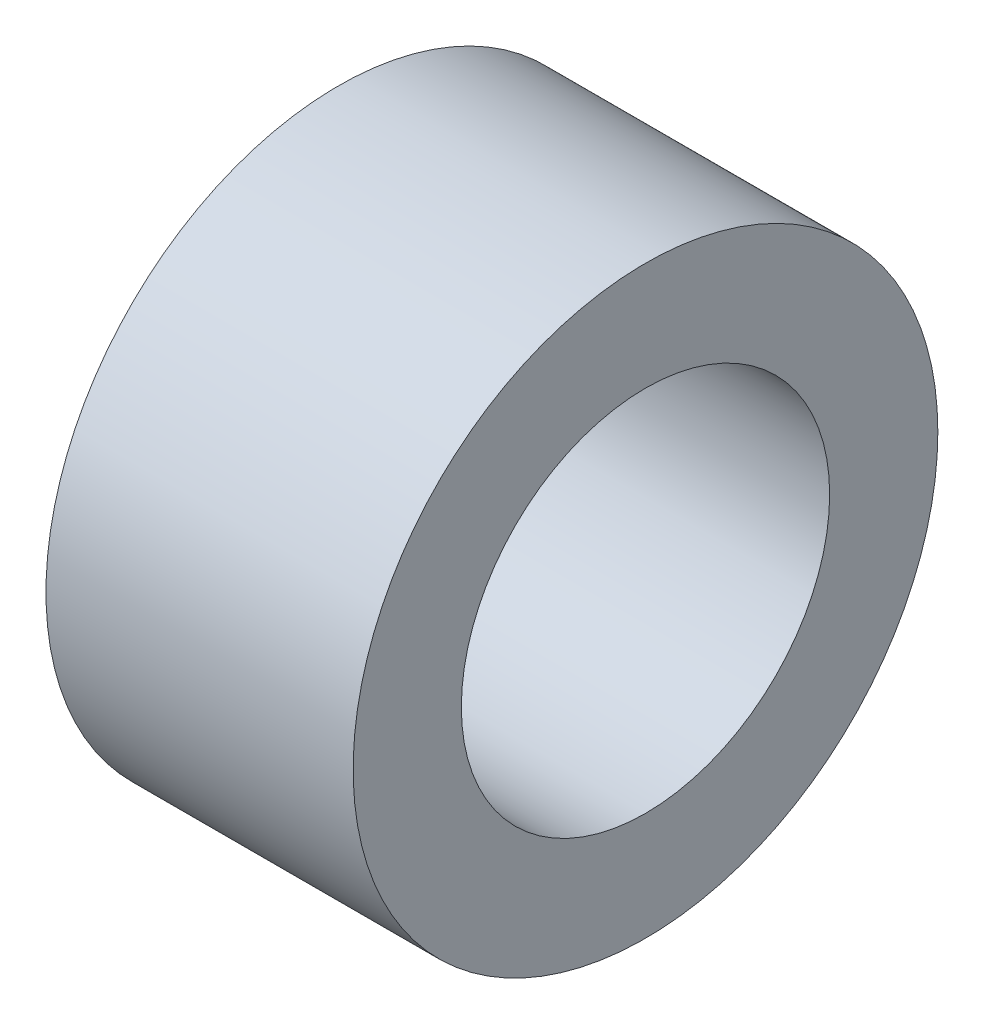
ISO-10303-21;
HEADER;
FILE_DESCRIPTION(('STEP AP214'),'2;1');
FILE_NAME('part.step','',(''),(''),'','','');
FILE_SCHEMA(('AUTOMOTIVE_DESIGN { 1 0 10303 214 1 1 1 1 }'));
ENDSEC;
DATA;
#1=APPLICATION_CONTEXT('core data for automotive mechanical design processes');
#2=APPLICATION_PROTOCOL_DEFINITION('international standard','automotive_design',2000,#1);
#3=PRODUCT_CONTEXT('',#1,'mechanical');
#4=PRODUCT('Part','Part','',(#3));
#5=PRODUCT_RELATED_PRODUCT_CATEGORY('part','',(#4));
#6=PRODUCT_DEFINITION_FORMATION('','',#4);
#7=PRODUCT_DEFINITION_CONTEXT('part definition',#1,'design');
#8=PRODUCT_DEFINITION('design','',#6,#7);
#9=PRODUCT_DEFINITION_SHAPE('','',#8);
#10=(LENGTH_UNIT() NAMED_UNIT(*) SI_UNIT(.MILLI.,.METRE.));
#11=(NAMED_UNIT(*) PLANE_ANGLE_UNIT() SI_UNIT($,.RADIAN.));
#12=(NAMED_UNIT(*) SI_UNIT($,.STERADIAN.) SOLID_ANGLE_UNIT());
#13=UNCERTAINTY_MEASURE_WITH_UNIT(LENGTH_MEASURE(1.E-05),#10,'distance_accuracy_value','');
#14=(GEOMETRIC_REPRESENTATION_CONTEXT(3) GLOBAL_UNCERTAINTY_ASSIGNED_CONTEXT((#13)) GLOBAL_UNIT_ASSIGNED_CONTEXT((#10,
#11,#12)) REPRESENTATION_CONTEXT('',''));
#15=CARTESIAN_POINT('',(0.,0.,0.));
#16=DIRECTION('',(0.,0.,1.));
#17=DIRECTION('',(1.,0.,0.));
#18=AXIS2_PLACEMENT_3D('',#15,#16,#17);
#19=CARTESIAN_POINT('',(10.0076,0.,0.));
#20=DIRECTION('',(1.,0.,0.));
#21=DIRECTION('',(0.,0.,-1.));
#22=AXIS2_PLACEMENT_3D('',#19,#20,#21);
#23=PLANE('',#22);
#24=CARTESIAN_POINT('',(10.0076,0.,0.));
#25=DIRECTION('',(1.,0.,0.));
#26=DIRECTION('',(0.,0.,-1.));
#27=AXIS2_PLACEMENT_3D('',#24,#25,#26);
#28=CIRCLE('',#27,9.525);
#29=CARTESIAN_POINT('',(10.0076,0.,-9.525));
#30=VERTEX_POINT('',#29);
#31=EDGE_CURVE('E10',#30,#30,#28,.T.);
#32=ORIENTED_EDGE('',*,*,#31,.T.);
#33=EDGE_LOOP('',(#32));
#34=FACE_BOUND('',#33,.T.);
#35=CARTESIAN_POINT('',(10.0076,0.,0.));
#36=DIRECTION('',(1.,0.,0.));
#37=DIRECTION('',(0.,0.,-1.));
#38=AXIS2_PLACEMENT_3D('',#35,#36,#37);
#39=CIRCLE('',#38,6.);
#40=CARTESIAN_POINT('',(10.0076,0.,-6.));
#41=VERTEX_POINT('',#40);
#42=EDGE_CURVE('E40',#41,#41,#39,.T.);
#43=ORIENTED_EDGE('',*,*,#42,.F.);
#44=EDGE_LOOP('',(#43));
#45=FACE_BOUND('',#44,.T.);
#46=ADVANCED_FACE('F29',(#34,#45),#23,.T.);
#47=CARTESIAN_POINT('',(0.,0.,0.));
#48=DIRECTION('',(1.,0.,0.));
#49=DIRECTION('',(0.,0.,-1.));
#50=AXIS2_PLACEMENT_3D('',#47,#48,#49);
#51=PLANE('',#50);
#52=CARTESIAN_POINT('',(0.,0.,0.));
#53=DIRECTION('',(1.,0.,0.));
#54=DIRECTION('',(0.,0.,-1.));
#55=AXIS2_PLACEMENT_3D('',#52,#53,#54);
#56=CIRCLE('',#55,9.525);
#57=CARTESIAN_POINT('',(0.,0.,-9.525));
#58=VERTEX_POINT('',#57);
#59=EDGE_CURVE('E33',#58,#58,#56,.T.);
#60=ORIENTED_EDGE('',*,*,#59,.F.);
#61=EDGE_LOOP('',(#60));
#62=FACE_BOUND('',#61,.T.);
#63=CARTESIAN_POINT('',(0.,0.,0.));
#64=DIRECTION('',(1.,0.,0.));
#65=DIRECTION('',(0.,0.,-1.));
#66=AXIS2_PLACEMENT_3D('',#63,#64,#65);
#67=CIRCLE('',#66,6.);
#68=CARTESIAN_POINT('',(0.,0.,-6.));
#69=VERTEX_POINT('',#68);
#70=EDGE_CURVE('E42',#69,#69,#67,.T.);
#71=ORIENTED_EDGE('',*,*,#70,.T.);
#72=EDGE_LOOP('',(#71));
#73=FACE_BOUND('',#72,.T.);
#74=ADVANCED_FACE('F52',(#62,#73),#51,.F.);
#75=CARTESIAN_POINT('',(10.0076,0.,0.));
#76=DIRECTION('',(-1.,0.,0.));
#77=DIRECTION('',(0.,0.,1.));
#78=AXIS2_PLACEMENT_3D('',#75,#76,#77);
#79=CYLINDRICAL_SURFACE('',#78,9.525);
#80=ORIENTED_EDGE('',*,*,#31,.F.);
#81=EDGE_LOOP('',(#80));
#82=FACE_BOUND('',#81,.T.);
#83=ORIENTED_EDGE('',*,*,#59,.T.);
#84=EDGE_LOOP('',(#83));
#85=FACE_BOUND('',#84,.T.);
#86=ADVANCED_FACE('F31',(#82,#85),#79,.T.);
#87=CARTESIAN_POINT('',(10.0076,0.,0.));
#88=DIRECTION('',(-1.,0.,0.));
#89=DIRECTION('',(0.,0.,1.));
#90=AXIS2_PLACEMENT_3D('',#87,#88,#89);
#91=CYLINDRICAL_SURFACE('',#90,6.);
#92=ORIENTED_EDGE('',*,*,#42,.T.);
#93=EDGE_LOOP('',(#92));
#94=FACE_BOUND('',#93,.T.);
#95=ORIENTED_EDGE('',*,*,#70,.F.);
#96=EDGE_LOOP('',(#95));
#97=FACE_BOUND('',#96,.T.);
#98=ADVANCED_FACE('F48',(#94,#97),#91,.F.);
#99=CLOSED_SHELL('',(#46,#74,#86,#98));
#100=MANIFOLD_SOLID_BREP('B2',#99);
#101=ADVANCED_BREP_SHAPE_REPRESENTATION('',(#18,#100),#14);
#102=SHAPE_DEFINITION_REPRESENTATION(#9,#101);
ENDSEC;
END-ISO-10303-21;
